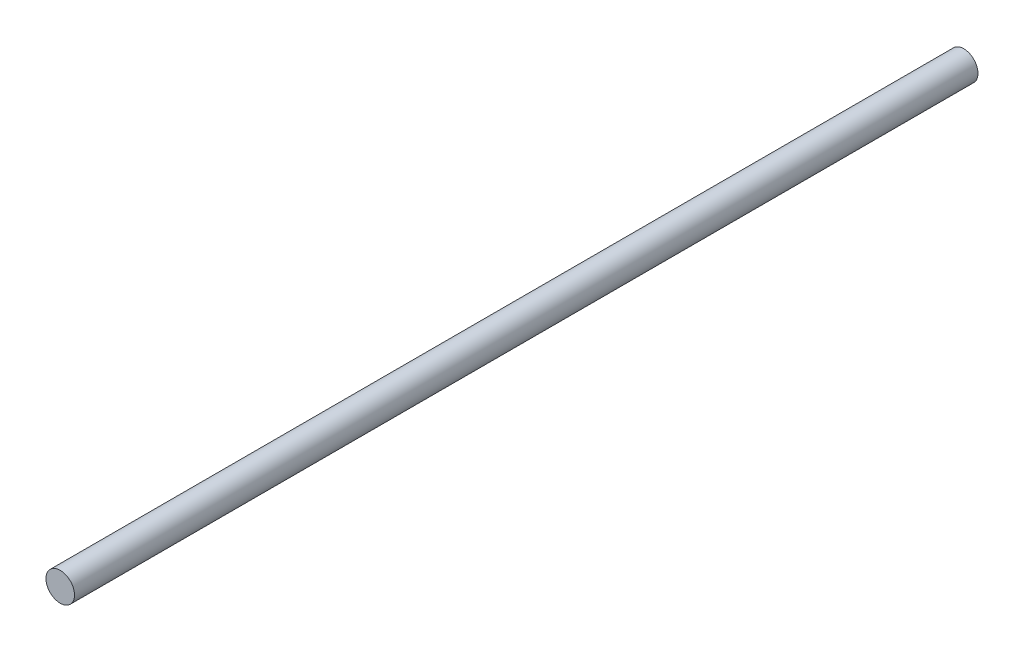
from build123d import *

# Parameters (mm, degrees)
SKETCH1_R           = 30
BOSS_EXTRUDE1_DEPTH = 1900


with BuildPart() as part:
    # Sketch1 → Boss-Extrude1 (new body)
    with BuildSketch(Plane.XY):
        Circle(SKETCH1_R)
    extrude(amount=-BOSS_EXTRUDE1_DEPTH)


solid = part.part
